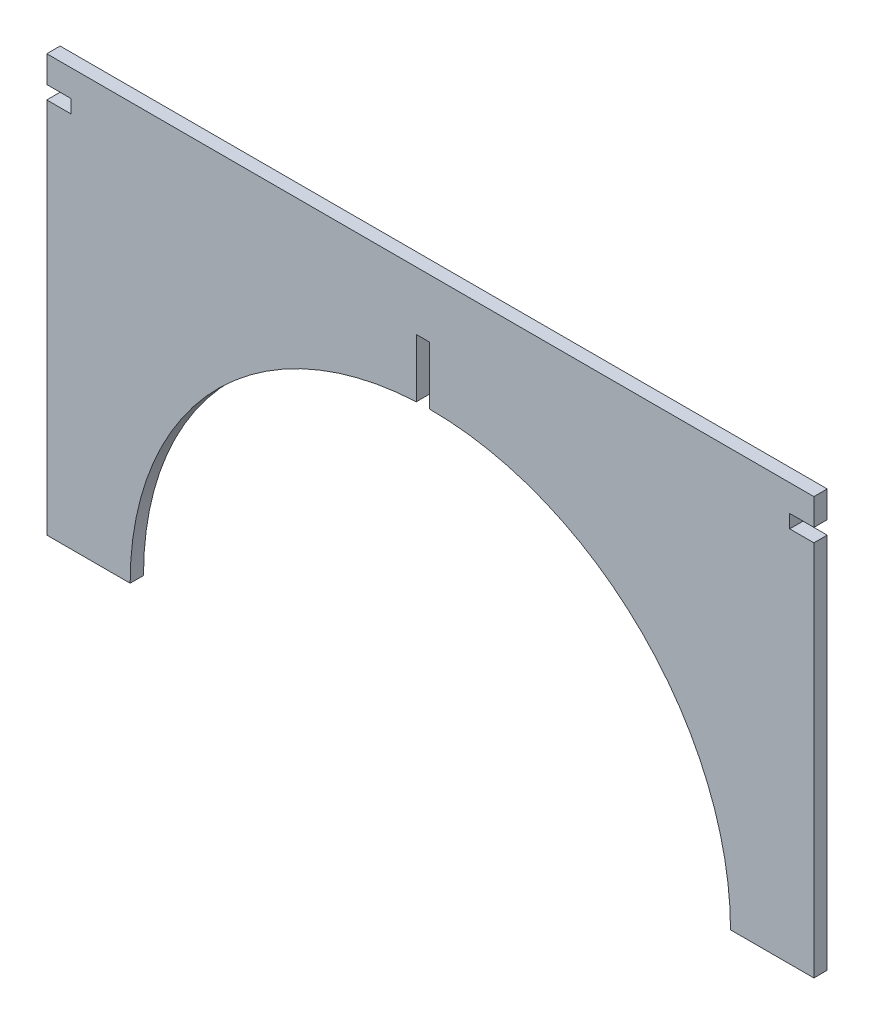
ISO-10303-21;
HEADER;
FILE_DESCRIPTION(('STEP AP214'),'2;1');
FILE_NAME('part.step','',(''),(''),'','','');
FILE_SCHEMA(('AUTOMOTIVE_DESIGN { 1 0 10303 214 1 1 1 1 }'));
ENDSEC;
DATA;
#1=APPLICATION_CONTEXT('core data for automotive mechanical design processes');
#2=APPLICATION_PROTOCOL_DEFINITION('international standard','automotive_design',2000,#1);
#3=PRODUCT_CONTEXT('',#1,'mechanical');
#4=PRODUCT('Part','Part','',(#3));
#5=PRODUCT_RELATED_PRODUCT_CATEGORY('part','',(#4));
#6=PRODUCT_DEFINITION_FORMATION('','',#4);
#7=PRODUCT_DEFINITION_CONTEXT('part definition',#1,'design');
#8=PRODUCT_DEFINITION('design','',#6,#7);
#9=PRODUCT_DEFINITION_SHAPE('','',#8);
#10=(LENGTH_UNIT() NAMED_UNIT(*) SI_UNIT(.MILLI.,.METRE.));
#11=(NAMED_UNIT(*) PLANE_ANGLE_UNIT() SI_UNIT($,.RADIAN.));
#12=(NAMED_UNIT(*) SI_UNIT($,.STERADIAN.) SOLID_ANGLE_UNIT());
#13=UNCERTAINTY_MEASURE_WITH_UNIT(LENGTH_MEASURE(1.E-05),#10,'distance_accuracy_value','');
#14=(GEOMETRIC_REPRESENTATION_CONTEXT(3) GLOBAL_UNCERTAINTY_ASSIGNED_CONTEXT((#13)) GLOBAL_UNIT_ASSIGNED_CONTEXT((#10,
#11,#12)) REPRESENTATION_CONTEXT('',''));
#15=CARTESIAN_POINT('',(0.,0.,0.));
#16=DIRECTION('',(0.,0.,1.));
#17=DIRECTION('',(1.,0.,0.));
#18=AXIS2_PLACEMENT_3D('',#15,#16,#17);
#19=CARTESIAN_POINT('',(-672.642560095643,353.821839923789,16.));
#20=DIRECTION('',(1.,0.,0.));
#21=DIRECTION('',(0.,0.,-1.));
#22=AXIS2_PLACEMENT_3D('',#19,#20,#21);
#23=PLANE('',#22);
#24=DIRECTION('',(0.,-1.,0.));
#25=VECTOR('',#24,1.);
#26=CARTESIAN_POINT('',(-672.642560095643,353.821839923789,16.));
#27=LINE('',#26,#25);
#28=CARTESIAN_POINT('',(-672.642560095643,305.821839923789,16.));
#29=VERTEX_POINT('',#28);
#30=CARTESIAN_POINT('',(-672.642560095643,-146.178160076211,16.));
#31=VERTEX_POINT('',#30);
#32=EDGE_CURVE('E226',#29,#31,#27,.T.);
#33=ORIENTED_EDGE('',*,*,#32,.F.);
#34=DIRECTION('',(0.,0.,1.));
#35=VECTOR('',#34,1.);
#36=CARTESIAN_POINT('',(-672.642560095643,305.821839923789,0.));
#37=LINE('',#36,#35);
#38=CARTESIAN_POINT('',(-672.642560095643,305.821839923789,0.));
#39=VERTEX_POINT('',#38);
#40=EDGE_CURVE('E189',#39,#29,#37,.T.);
#41=ORIENTED_EDGE('',*,*,#40,.F.);
#42=DIRECTION('',(0.,-1.,0.));
#43=VECTOR('',#42,1.);
#44=CARTESIAN_POINT('',(-672.642560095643,353.821839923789,0.));
#45=LINE('',#44,#43);
#46=CARTESIAN_POINT('',(-672.642560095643,-146.178160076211,0.));
#47=VERTEX_POINT('',#46);
#48=EDGE_CURVE('E251',#39,#47,#45,.T.);
#49=ORIENTED_EDGE('',*,*,#48,.T.);
#50=DIRECTION('',(0.,0.,-1.));
#51=VECTOR('',#50,1.);
#52=CARTESIAN_POINT('',(-672.642560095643,-146.178160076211,16.));
#53=LINE('',#52,#51);
#54=EDGE_CURVE('E282',#31,#47,#53,.T.);
#55=ORIENTED_EDGE('',*,*,#54,.F.);
#56=EDGE_LOOP('',(#33,#41,#49,#55));
#57=FACE_BOUND('',#56,.T.);
#58=ADVANCED_FACE('F33',(#57),#23,.F.);
#59=CARTESIAN_POINT('',(247.357439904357,353.821839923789,16.));
#60=DIRECTION('',(-1.,0.,0.));
#61=DIRECTION('',(0.,-1.,0.));
#62=AXIS2_PLACEMENT_3D('',#59,#60,#61);
#63=PLANE('',#62);
#64=DIRECTION('',(0.,1.,0.));
#65=VECTOR('',#64,1.);
#66=CARTESIAN_POINT('',(247.357439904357,353.821839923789,0.));
#67=LINE('',#66,#65);
#68=CARTESIAN_POINT('',(247.357439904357,-146.178160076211,0.));
#69=VERTEX_POINT('',#68);
#70=CARTESIAN_POINT('',(247.357439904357,305.821839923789,0.));
#71=VERTEX_POINT('',#70);
#72=EDGE_CURVE('E246',#69,#71,#67,.T.);
#73=ORIENTED_EDGE('',*,*,#72,.T.);
#74=DIRECTION('',(0.,0.,1.));
#75=VECTOR('',#74,1.);
#76=CARTESIAN_POINT('',(247.357439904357,305.821839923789,0.));
#77=LINE('',#76,#75);
#78=CARTESIAN_POINT('',(247.357439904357,305.821839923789,16.));
#79=VERTEX_POINT('',#78);
#80=EDGE_CURVE('E207',#71,#79,#77,.T.);
#81=ORIENTED_EDGE('',*,*,#80,.T.);
#82=DIRECTION('',(0.,1.,0.));
#83=VECTOR('',#82,1.);
#84=CARTESIAN_POINT('',(247.357439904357,353.821839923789,16.));
#85=LINE('',#84,#83);
#86=CARTESIAN_POINT('',(247.357439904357,-146.178160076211,16.));
#87=VERTEX_POINT('',#86);
#88=EDGE_CURVE('E221',#87,#79,#85,.T.);
#89=ORIENTED_EDGE('',*,*,#88,.F.);
#90=DIRECTION('',(0.,0.,-1.));
#91=VECTOR('',#90,1.);
#92=CARTESIAN_POINT('',(247.357439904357,-146.178160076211,16.));
#93=LINE('',#92,#91);
#94=EDGE_CURVE('E11',#87,#69,#93,.T.);
#95=ORIENTED_EDGE('',*,*,#94,.T.);
#96=EDGE_LOOP('',(#73,#81,#89,#95));
#97=FACE_BOUND('',#96,.T.);
#98=ADVANCED_FACE('F313',(#97),#63,.F.);
#99=CARTESIAN_POINT('',(147.357439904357,-146.178160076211,16.));
#100=DIRECTION('',(0.,1.,0.));
#101=DIRECTION('',(0.,0.,1.));
#102=AXIS2_PLACEMENT_3D('',#99,#100,#101);
#103=PLANE('',#102);
#104=DIRECTION('',(1.,0.,0.));
#105=VECTOR('',#104,1.);
#106=CARTESIAN_POINT('',(147.357439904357,-146.178160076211,0.));
#107=LINE('',#106,#105);
#108=CARTESIAN_POINT('',(147.357439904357,-146.178160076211,0.));
#109=VERTEX_POINT('',#108);
#110=EDGE_CURVE('E210',#109,#69,#107,.T.);
#111=ORIENTED_EDGE('',*,*,#110,.T.);
#112=ORIENTED_EDGE('',*,*,#94,.F.);
#113=DIRECTION('',(1.,0.,0.));
#114=VECTOR('',#113,1.);
#115=CARTESIAN_POINT('',(147.357439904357,-146.178160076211,16.));
#116=LINE('',#115,#114);
#117=CARTESIAN_POINT('',(147.357439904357,-146.178160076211,16.));
#118=VERTEX_POINT('',#117);
#119=EDGE_CURVE('E216',#118,#87,#116,.T.);
#120=ORIENTED_EDGE('',*,*,#119,.F.);
#121=DIRECTION('',(0.,0.,-1.));
#122=VECTOR('',#121,1.);
#123=CARTESIAN_POINT('',(147.357439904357,-146.178160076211,16.));
#124=LINE('',#123,#122);
#125=EDGE_CURVE('E242',#118,#109,#124,.T.);
#126=ORIENTED_EDGE('',*,*,#125,.T.);
#127=EDGE_LOOP('',(#111,#112,#120,#126));
#128=FACE_BOUND('',#127,.T.);
#129=ADVANCED_FACE('F35',(#128),#103,.F.);
#130=CARTESIAN_POINT('',(247.357439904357,321.821839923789,16.));
#131=VERTEX_POINT('',#130);
#132=CARTESIAN_POINT('',(247.357439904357,353.821839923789,16.));
#133=VERTEX_POINT('',#132);
#134=EDGE_CURVE('E219',#131,#133,#85,.T.);
#135=ORIENTED_EDGE('',*,*,#134,.F.);
#136=DIRECTION('',(0.,0.,1.));
#137=VECTOR('',#136,1.);
#138=CARTESIAN_POINT('',(247.357439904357,321.821839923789,0.));
#139=LINE('',#138,#137);
#140=CARTESIAN_POINT('',(247.357439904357,321.821839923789,0.));
#141=VERTEX_POINT('',#140);
#142=EDGE_CURVE('E200',#141,#131,#139,.T.);
#143=ORIENTED_EDGE('',*,*,#142,.F.);
#144=CARTESIAN_POINT('',(247.357439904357,353.821839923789,0.));
#145=VERTEX_POINT('',#144);
#146=EDGE_CURVE('E245',#141,#145,#67,.T.);
#147=ORIENTED_EDGE('',*,*,#146,.T.);
#148=DIRECTION('',(0.,0.,-1.));
#149=VECTOR('',#148,1.);
#150=CARTESIAN_POINT('',(247.357439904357,353.821839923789,16.));
#151=LINE('',#150,#149);
#152=EDGE_CURVE('E41',#133,#145,#151,.T.);
#153=ORIENTED_EDGE('',*,*,#152,.F.);
#154=EDGE_LOOP('',(#135,#143,#147,#153));
#155=FACE_BOUND('',#154,.T.);
#156=ADVANCED_FACE('F306',(#155),#63,.F.);
#157=CARTESIAN_POINT('',(-672.642560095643,353.821839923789,16.));
#158=DIRECTION('',(0.,-1.,0.));
#159=DIRECTION('',(0.,0.,-1.));
#160=AXIS2_PLACEMENT_3D('',#157,#158,#159);
#161=PLANE('',#160);
#162=DIRECTION('',(-1.,0.,0.));
#163=VECTOR('',#162,1.);
#164=CARTESIAN_POINT('',(-672.642560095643,353.821839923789,0.));
#165=LINE('',#164,#163);
#166=CARTESIAN_POINT('',(-672.642560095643,353.821839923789,0.));
#167=VERTEX_POINT('',#166);
#168=EDGE_CURVE('E249',#145,#167,#165,.T.);
#169=ORIENTED_EDGE('',*,*,#168,.T.);
#170=DIRECTION('',(0.,0.,-1.));
#171=VECTOR('',#170,1.);
#172=CARTESIAN_POINT('',(-672.642560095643,353.821839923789,16.));
#173=LINE('',#172,#171);
#174=CARTESIAN_POINT('',(-672.642560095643,353.821839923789,16.));
#175=VERTEX_POINT('',#174);
#176=EDGE_CURVE('E285',#175,#167,#173,.T.);
#177=ORIENTED_EDGE('',*,*,#176,.F.);
#178=DIRECTION('',(-1.,0.,0.));
#179=VECTOR('',#178,1.);
#180=CARTESIAN_POINT('',(-672.642560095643,353.821839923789,16.));
#181=LINE('',#180,#179);
#182=EDGE_CURVE('E224',#133,#175,#181,.T.);
#183=ORIENTED_EDGE('',*,*,#182,.F.);
#184=ORIENTED_EDGE('',*,*,#152,.T.);
#185=EDGE_LOOP('',(#169,#177,#183,#184));
#186=FACE_BOUND('',#185,.T.);
#187=ADVANCED_FACE('F292',(#186),#161,.F.);
#188=CARTESIAN_POINT('',(-672.642560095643,321.821839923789,0.));
#189=VERTEX_POINT('',#188);
#190=EDGE_CURVE('E252',#167,#189,#45,.T.);
#191=ORIENTED_EDGE('',*,*,#190,.T.);
#192=DIRECTION('',(0.,0.,1.));
#193=VECTOR('',#192,1.);
#194=CARTESIAN_POINT('',(-672.642560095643,321.821839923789,0.));
#195=LINE('',#194,#193);
#196=CARTESIAN_POINT('',(-672.642560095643,321.821839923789,16.));
#197=VERTEX_POINT('',#196);
#198=EDGE_CURVE('E48',#189,#197,#195,.T.);
#199=ORIENTED_EDGE('',*,*,#198,.T.);
#200=EDGE_CURVE('E227',#175,#197,#27,.T.);
#201=ORIENTED_EDGE('',*,*,#200,.F.);
#202=ORIENTED_EDGE('',*,*,#176,.T.);
#203=EDGE_LOOP('',(#191,#199,#201,#202));
#204=FACE_BOUND('',#203,.T.);
#205=ADVANCED_FACE('F298',(#204),#23,.F.);
#206=CARTESIAN_POINT('',(-672.642560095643,-146.178160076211,16.));
#207=DIRECTION('',(0.,1.,0.));
#208=DIRECTION('',(0.,0.,1.));
#209=AXIS2_PLACEMENT_3D('',#206,#207,#208);
#210=PLANE('',#209);
#211=DIRECTION('',(1.,0.,0.));
#212=VECTOR('',#211,1.);
#213=CARTESIAN_POINT('',(-672.642560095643,-146.178160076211,0.));
#214=LINE('',#213,#212);
#215=CARTESIAN_POINT('',(-572.642560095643,-146.178160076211,0.));
#216=VERTEX_POINT('',#215);
#217=EDGE_CURVE('E254',#47,#216,#214,.T.);
#218=ORIENTED_EDGE('',*,*,#217,.T.);
#219=DIRECTION('',(0.,0.,-1.));
#220=VECTOR('',#219,1.);
#221=CARTESIAN_POINT('',(-572.642560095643,-146.178160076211,16.));
#222=LINE('',#221,#220);
#223=CARTESIAN_POINT('',(-572.642560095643,-146.178160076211,16.));
#224=VERTEX_POINT('',#223);
#225=EDGE_CURVE('E279',#224,#216,#222,.T.);
#226=ORIENTED_EDGE('',*,*,#225,.F.);
#227=DIRECTION('',(1.,0.,0.));
#228=VECTOR('',#227,1.);
#229=CARTESIAN_POINT('',(-672.642560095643,-146.178160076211,16.));
#230=LINE('',#229,#228);
#231=EDGE_CURVE('E230',#31,#224,#230,.T.);
#232=ORIENTED_EDGE('',*,*,#231,.F.);
#233=ORIENTED_EDGE('',*,*,#54,.T.);
#234=EDGE_LOOP('',(#218,#226,#232,#233));
#235=FACE_BOUND('',#234,.T.);
#236=ADVANCED_FACE('F346',(#235),#210,.F.);
#237=CARTESIAN_POINT('',(-212.642560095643,-145.783589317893,16.));
#238=DIRECTION('',(0.,0.,-1.));
#239=DIRECTION('',(-1.,0.,0.));
#240=AXIS2_PLACEMENT_3D('',#237,#238,#239);
#241=CYLINDRICAL_SURFACE('',#240,360.000216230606);
#242=CARTESIAN_POINT('',(-212.642560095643,-145.783589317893,0.));
#243=DIRECTION('',(0.,0.,-1.));
#244=DIRECTION('',(1.,0.,0.));
#245=AXIS2_PLACEMENT_3D('',#242,#243,#244);
#246=CIRCLE('',#245,360.000216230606);
#247=CARTESIAN_POINT('',(-229.497557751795,213.821839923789,0.));
#248=VERTEX_POINT('',#247);
#249=EDGE_CURVE('E256',#216,#248,#246,.T.);
#250=ORIENTED_EDGE('',*,*,#249,.T.);
#251=DIRECTION('',(0.,0.,-1.));
#252=VECTOR('',#251,1.);
#253=CARTESIAN_POINT('',(-229.497557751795,213.821839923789,16.));
#254=LINE('',#253,#252);
#255=CARTESIAN_POINT('',(-229.497557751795,213.821839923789,16.));
#256=VERTEX_POINT('',#255);
#257=EDGE_CURVE('E276',#256,#248,#254,.T.);
#258=ORIENTED_EDGE('',*,*,#257,.F.);
#259=CARTESIAN_POINT('',(-212.642560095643,-145.783589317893,16.));
#260=DIRECTION('',(0.,0.,-1.));
#261=DIRECTION('',(1.,0.,0.));
#262=AXIS2_PLACEMENT_3D('',#259,#260,#261);
#263=CIRCLE('',#262,360.000216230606);
#264=EDGE_CURVE('E232',#224,#256,#263,.T.);
#265=ORIENTED_EDGE('',*,*,#264,.F.);
#266=ORIENTED_EDGE('',*,*,#225,.T.);
#267=EDGE_LOOP('',(#250,#258,#265,#266));
#268=FACE_BOUND('',#267,.T.);
#269=ADVANCED_FACE('F342',(#268),#241,.F.);
#270=CARTESIAN_POINT('',(-229.497557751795,283.821839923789,16.));
#271=DIRECTION('',(-1.,0.,0.));
#272=DIRECTION('',(0.,0.,1.));
#273=AXIS2_PLACEMENT_3D('',#270,#271,#272);
#274=PLANE('',#273);
#275=DIRECTION('',(0.,1.,0.));
#276=VECTOR('',#275,1.);
#277=CARTESIAN_POINT('',(-229.497557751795,283.821839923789,0.));
#278=LINE('',#277,#276);
#279=CARTESIAN_POINT('',(-229.497557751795,283.821839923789,0.));
#280=VERTEX_POINT('',#279);
#281=EDGE_CURVE('E258',#248,#280,#278,.T.);
#282=ORIENTED_EDGE('',*,*,#281,.T.);
#283=DIRECTION('',(0.,0.,-1.));
#284=VECTOR('',#283,1.);
#285=CARTESIAN_POINT('',(-229.497557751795,283.821839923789,16.));
#286=LINE('',#285,#284);
#287=CARTESIAN_POINT('',(-229.497557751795,283.821839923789,16.));
#288=VERTEX_POINT('',#287);
#289=EDGE_CURVE('E273',#288,#280,#286,.T.);
#290=ORIENTED_EDGE('',*,*,#289,.F.);
#291=DIRECTION('',(0.,1.,0.));
#292=VECTOR('',#291,1.);
#293=CARTESIAN_POINT('',(-229.497557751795,283.821839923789,16.));
#294=LINE('',#293,#292);
#295=EDGE_CURVE('E234',#256,#288,#294,.T.);
#296=ORIENTED_EDGE('',*,*,#295,.F.);
#297=ORIENTED_EDGE('',*,*,#257,.T.);
#298=EDGE_LOOP('',(#282,#290,#296,#297));
#299=FACE_BOUND('',#298,.T.);
#300=ADVANCED_FACE('F337',(#299),#274,.F.);
#301=CARTESIAN_POINT('',(-229.497557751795,283.821839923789,16.));
#302=DIRECTION('',(0.,1.,0.));
#303=DIRECTION('',(0.,0.,1.));
#304=AXIS2_PLACEMENT_3D('',#301,#302,#303);
#305=PLANE('',#304);
#306=DIRECTION('',(1.,0.,0.));
#307=VECTOR('',#306,1.);
#308=CARTESIAN_POINT('',(-229.497557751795,283.821839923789,0.));
#309=LINE('',#308,#307);
#310=CARTESIAN_POINT('',(-213.497557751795,283.821839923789,0.));
#311=VERTEX_POINT('',#310);
#312=EDGE_CURVE('E260',#280,#311,#309,.T.);
#313=ORIENTED_EDGE('',*,*,#312,.T.);
#314=DIRECTION('',(0.,0.,-1.));
#315=VECTOR('',#314,1.);
#316=CARTESIAN_POINT('',(-213.497557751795,283.821839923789,16.));
#317=LINE('',#316,#315);
#318=CARTESIAN_POINT('',(-213.497557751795,283.821839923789,16.));
#319=VERTEX_POINT('',#318);
#320=EDGE_CURVE('E270',#319,#311,#317,.T.);
#321=ORIENTED_EDGE('',*,*,#320,.F.);
#322=DIRECTION('',(1.,0.,0.));
#323=VECTOR('',#322,1.);
#324=CARTESIAN_POINT('',(-229.497557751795,283.821839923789,16.));
#325=LINE('',#324,#323);
#326=EDGE_CURVE('E236',#288,#319,#325,.T.);
#327=ORIENTED_EDGE('',*,*,#326,.F.);
#328=ORIENTED_EDGE('',*,*,#289,.T.);
#329=EDGE_LOOP('',(#313,#321,#327,#328));
#330=FACE_BOUND('',#329,.T.);
#331=ADVANCED_FACE('F331',(#330),#305,.F.);
#332=CARTESIAN_POINT('',(-213.497557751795,283.821839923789,16.));
#333=DIRECTION('',(1.,0.,0.));
#334=DIRECTION('',(0.,0.,-1.));
#335=AXIS2_PLACEMENT_3D('',#332,#333,#334);
#336=PLANE('',#335);
#337=DIRECTION('',(0.,-1.,0.));
#338=VECTOR('',#337,1.);
#339=CARTESIAN_POINT('',(-213.497557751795,283.821839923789,0.));
#340=LINE('',#339,#338);
#341=CARTESIAN_POINT('',(-213.497557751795,214.215611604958,0.));
#342=VERTEX_POINT('',#341);
#343=EDGE_CURVE('E262',#311,#342,#340,.T.);
#344=ORIENTED_EDGE('',*,*,#343,.T.);
#345=DIRECTION('',(0.,0.,-1.));
#346=VECTOR('',#345,1.);
#347=CARTESIAN_POINT('',(-213.497557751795,214.215611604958,16.));
#348=LINE('',#347,#346);
#349=CARTESIAN_POINT('',(-213.497557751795,214.215611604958,16.));
#350=VERTEX_POINT('',#349);
#351=EDGE_CURVE('E267',#350,#342,#348,.T.);
#352=ORIENTED_EDGE('',*,*,#351,.F.);
#353=DIRECTION('',(0.,-1.,0.));
#354=VECTOR('',#353,1.);
#355=CARTESIAN_POINT('',(-213.497557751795,283.821839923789,16.));
#356=LINE('',#355,#354);
#357=EDGE_CURVE('E238',#319,#350,#356,.T.);
#358=ORIENTED_EDGE('',*,*,#357,.F.);
#359=ORIENTED_EDGE('',*,*,#320,.T.);
#360=EDGE_LOOP('',(#344,#352,#358,#359));
#361=FACE_BOUND('',#360,.T.);
#362=ADVANCED_FACE('F327',(#361),#336,.F.);
#363=CARTESIAN_POINT('',(-212.642560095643,-145.783589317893,16.));
#364=DIRECTION('',(0.,0.,-1.));
#365=DIRECTION('',(-1.,0.,0.));
#366=AXIS2_PLACEMENT_3D('',#363,#364,#365);
#367=CYLINDRICAL_SURFACE('',#366,360.000216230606);
#368=CARTESIAN_POINT('',(-212.642560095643,-145.783589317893,0.));
#369=DIRECTION('',(0.,0.,-1.));
#370=DIRECTION('',(1.,0.,0.));
#371=AXIS2_PLACEMENT_3D('',#368,#369,#370);
#372=CIRCLE('',#371,360.000216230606);
#373=EDGE_CURVE('E220',#342,#109,#372,.T.);
#374=ORIENTED_EDGE('',*,*,#373,.T.);
#375=ORIENTED_EDGE('',*,*,#125,.F.);
#376=CARTESIAN_POINT('',(-212.642560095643,-145.783589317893,16.));
#377=DIRECTION('',(0.,0.,-1.));
#378=DIRECTION('',(1.,0.,0.));
#379=AXIS2_PLACEMENT_3D('',#376,#377,#378);
#380=CIRCLE('',#379,360.000216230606);
#381=EDGE_CURVE('E240',#350,#118,#380,.T.);
#382=ORIENTED_EDGE('',*,*,#381,.F.);
#383=ORIENTED_EDGE('',*,*,#351,.T.);
#384=EDGE_LOOP('',(#374,#375,#382,#383));
#385=FACE_BOUND('',#384,.T.);
#386=ADVANCED_FACE('F322',(#385),#367,.F.);
#387=CARTESIAN_POINT('',(-212.642560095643,-145.783589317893,16.));
#388=DIRECTION('',(0.,0.,1.));
#389=DIRECTION('',(1.,0.,0.));
#390=AXIS2_PLACEMENT_3D('',#387,#388,#389);
#391=PLANE('',#390);
#392=DIRECTION('',(1.,0.,0.));
#393=VECTOR('',#392,1.);
#394=CARTESIAN_POINT('',(-672.642560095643,305.821839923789,16.));
#395=LINE('',#394,#393);
#396=CARTESIAN_POINT('',(-643.642560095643,305.821839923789,16.));
#397=VERTEX_POINT('',#396);
#398=EDGE_CURVE('E177',#29,#397,#395,.T.);
#399=ORIENTED_EDGE('',*,*,#398,.F.);
#400=ORIENTED_EDGE('',*,*,#32,.T.);
#401=ORIENTED_EDGE('',*,*,#231,.T.);
#402=ORIENTED_EDGE('',*,*,#264,.T.);
#403=ORIENTED_EDGE('',*,*,#295,.T.);
#404=ORIENTED_EDGE('',*,*,#326,.T.);
#405=ORIENTED_EDGE('',*,*,#357,.T.);
#406=ORIENTED_EDGE('',*,*,#381,.T.);
#407=ORIENTED_EDGE('',*,*,#119,.T.);
#408=ORIENTED_EDGE('',*,*,#88,.T.);
#409=DIRECTION('',(1.,0.,0.));
#410=VECTOR('',#409,1.);
#411=CARTESIAN_POINT('',(218.357439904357,305.821839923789,16.));
#412=LINE('',#411,#410);
#413=CARTESIAN_POINT('',(218.357439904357,305.821839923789,16.));
#414=VERTEX_POINT('',#413);
#415=EDGE_CURVE('E195',#414,#79,#412,.T.);
#416=ORIENTED_EDGE('',*,*,#415,.F.);
#417=DIRECTION('',(0.,-1.,0.));
#418=VECTOR('',#417,1.);
#419=CARTESIAN_POINT('',(218.357439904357,321.821839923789,16.));
#420=LINE('',#419,#418);
#421=CARTESIAN_POINT('',(218.357439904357,321.821839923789,16.));
#422=VERTEX_POINT('',#421);
#423=EDGE_CURVE('E203',#422,#414,#420,.T.);
#424=ORIENTED_EDGE('',*,*,#423,.F.);
#425=DIRECTION('',(-1.,0.,0.));
#426=VECTOR('',#425,1.);
#427=CARTESIAN_POINT('',(218.357439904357,321.821839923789,16.));
#428=LINE('',#427,#426);
#429=EDGE_CURVE('E188',#131,#422,#428,.T.);
#430=ORIENTED_EDGE('',*,*,#429,.F.);
#431=ORIENTED_EDGE('',*,*,#134,.T.);
#432=ORIENTED_EDGE('',*,*,#182,.T.);
#433=ORIENTED_EDGE('',*,*,#200,.T.);
#434=DIRECTION('',(-1.,0.,0.));
#435=VECTOR('',#434,1.);
#436=CARTESIAN_POINT('',(-672.642560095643,321.821839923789,16.));
#437=LINE('',#436,#435);
#438=CARTESIAN_POINT('',(-643.642560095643,321.821839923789,16.));
#439=VERTEX_POINT('',#438);
#440=EDGE_CURVE('E180',#439,#197,#437,.T.);
#441=ORIENTED_EDGE('',*,*,#440,.F.);
#442=DIRECTION('',(0.,1.,0.));
#443=VECTOR('',#442,1.);
#444=CARTESIAN_POINT('',(-643.642560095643,321.821839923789,16.));
#445=LINE('',#444,#443);
#446=EDGE_CURVE('E165',#397,#439,#445,.T.);
#447=ORIENTED_EDGE('',*,*,#446,.F.);
#448=EDGE_LOOP('',(#399,#400,#401,#402,#403,#404,#405,#406,#407,#408,#416,#424,#430,#431,#432,
#433,#441,#447));
#449=FACE_BOUND('',#448,.T.);
#450=ADVANCED_FACE('F302',(#449),#391,.T.);
#451=CARTESIAN_POINT('',(-212.642560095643,-145.783589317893,0.));
#452=DIRECTION('',(0.,0.,1.));
#453=DIRECTION('',(1.,0.,0.));
#454=AXIS2_PLACEMENT_3D('',#451,#452,#453);
#455=PLANE('',#454);
#456=ORIENTED_EDGE('',*,*,#48,.F.);
#457=DIRECTION('',(1.,0.,0.));
#458=VECTOR('',#457,1.);
#459=CARTESIAN_POINT('',(-672.642560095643,305.821839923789,0.));
#460=LINE('',#459,#458);
#461=CARTESIAN_POINT('',(-643.642560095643,305.821839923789,0.));
#462=VERTEX_POINT('',#461);
#463=EDGE_CURVE('E167',#39,#462,#460,.T.);
#464=ORIENTED_EDGE('',*,*,#463,.T.);
#465=DIRECTION('',(0.,1.,0.));
#466=VECTOR('',#465,1.);
#467=CARTESIAN_POINT('',(-643.642560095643,321.821839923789,0.));
#468=LINE('',#467,#466);
#469=CARTESIAN_POINT('',(-643.642560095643,321.821839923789,0.));
#470=VERTEX_POINT('',#469);
#471=EDGE_CURVE('E162',#462,#470,#468,.T.);
#472=ORIENTED_EDGE('',*,*,#471,.T.);
#473=DIRECTION('',(-1.,0.,0.));
#474=VECTOR('',#473,1.);
#475=CARTESIAN_POINT('',(-672.642560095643,321.821839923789,0.));
#476=LINE('',#475,#474);
#477=EDGE_CURVE('E169',#470,#189,#476,.T.);
#478=ORIENTED_EDGE('',*,*,#477,.T.);
#479=ORIENTED_EDGE('',*,*,#190,.F.);
#480=ORIENTED_EDGE('',*,*,#168,.F.);
#481=ORIENTED_EDGE('',*,*,#146,.F.);
#482=DIRECTION('',(-1.,0.,0.));
#483=VECTOR('',#482,1.);
#484=CARTESIAN_POINT('',(218.357439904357,321.821839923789,0.));
#485=LINE('',#484,#483);
#486=CARTESIAN_POINT('',(218.357439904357,321.821839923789,0.));
#487=VERTEX_POINT('',#486);
#488=EDGE_CURVE('E192',#141,#487,#485,.T.);
#489=ORIENTED_EDGE('',*,*,#488,.T.);
#490=DIRECTION('',(0.,-1.,0.));
#491=VECTOR('',#490,1.);
#492=CARTESIAN_POINT('',(218.357439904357,321.821839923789,0.));
#493=LINE('',#492,#491);
#494=CARTESIAN_POINT('',(218.357439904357,305.821839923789,0.));
#495=VERTEX_POINT('',#494);
#496=EDGE_CURVE('E56',#487,#495,#493,.T.);
#497=ORIENTED_EDGE('',*,*,#496,.T.);
#498=DIRECTION('',(1.,0.,0.));
#499=VECTOR('',#498,1.);
#500=CARTESIAN_POINT('',(218.357439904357,305.821839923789,0.));
#501=LINE('',#500,#499);
#502=EDGE_CURVE('E197',#495,#71,#501,.T.);
#503=ORIENTED_EDGE('',*,*,#502,.T.);
#504=ORIENTED_EDGE('',*,*,#72,.F.);
#505=ORIENTED_EDGE('',*,*,#110,.F.);
#506=ORIENTED_EDGE('',*,*,#373,.F.);
#507=ORIENTED_EDGE('',*,*,#343,.F.);
#508=ORIENTED_EDGE('',*,*,#312,.F.);
#509=ORIENTED_EDGE('',*,*,#281,.F.);
#510=ORIENTED_EDGE('',*,*,#249,.F.);
#511=ORIENTED_EDGE('',*,*,#217,.F.);
#512=EDGE_LOOP('',(#456,#464,#472,#478,#479,#480,#481,#489,#497,#503,#504,#505,#506,#507,#508,
#509,#510,#511));
#513=FACE_BOUND('',#512,.T.);
#514=ADVANCED_FACE('F176',(#513),#455,.F.);
#515=CARTESIAN_POINT('',(218.357439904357,305.821839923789,0.));
#516=DIRECTION('',(0.,-1.,0.));
#517=DIRECTION('',(0.,0.,-1.));
#518=AXIS2_PLACEMENT_3D('',#515,#516,#517);
#519=PLANE('',#518);
#520=ORIENTED_EDGE('',*,*,#415,.T.);
#521=ORIENTED_EDGE('',*,*,#80,.F.);
#522=ORIENTED_EDGE('',*,*,#502,.F.);
#523=DIRECTION('',(0.,0.,1.));
#524=VECTOR('',#523,1.);
#525=CARTESIAN_POINT('',(218.357439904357,305.821839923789,0.));
#526=LINE('',#525,#524);
#527=EDGE_CURVE('E211',#495,#414,#526,.T.);
#528=ORIENTED_EDGE('',*,*,#527,.T.);
#529=EDGE_LOOP('',(#520,#521,#522,#528));
#530=FACE_BOUND('',#529,.T.);
#531=ADVANCED_FACE('F354',(#530),#519,.F.);
#532=CARTESIAN_POINT('',(218.357439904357,321.821839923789,0.));
#533=DIRECTION('',(-1.,0.,0.));
#534=DIRECTION('',(0.,0.,1.));
#535=AXIS2_PLACEMENT_3D('',#532,#533,#534);
#536=PLANE('',#535);
#537=ORIENTED_EDGE('',*,*,#423,.T.);
#538=ORIENTED_EDGE('',*,*,#527,.F.);
#539=ORIENTED_EDGE('',*,*,#496,.F.);
#540=DIRECTION('',(0.,0.,1.));
#541=VECTOR('',#540,1.);
#542=CARTESIAN_POINT('',(218.357439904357,321.821839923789,0.));
#543=LINE('',#542,#541);
#544=EDGE_CURVE('E213',#487,#422,#543,.T.);
#545=ORIENTED_EDGE('',*,*,#544,.T.);
#546=EDGE_LOOP('',(#537,#538,#539,#545));
#547=FACE_BOUND('',#546,.T.);
#548=ADVANCED_FACE('F355',(#547),#536,.F.);
#549=CARTESIAN_POINT('',(218.357439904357,321.821839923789,0.));
#550=DIRECTION('',(0.,1.,0.));
#551=DIRECTION('',(0.,0.,1.));
#552=AXIS2_PLACEMENT_3D('',#549,#550,#551);
#553=PLANE('',#552);
#554=ORIENTED_EDGE('',*,*,#429,.T.);
#555=ORIENTED_EDGE('',*,*,#544,.F.);
#556=ORIENTED_EDGE('',*,*,#488,.F.);
#557=ORIENTED_EDGE('',*,*,#142,.T.);
#558=EDGE_LOOP('',(#554,#555,#556,#557));
#559=FACE_BOUND('',#558,.T.);
#560=ADVANCED_FACE('F308',(#559),#553,.F.);
#561=CARTESIAN_POINT('',(-643.642560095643,321.821839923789,0.));
#562=DIRECTION('',(1.,0.,0.));
#563=DIRECTION('',(0.,1.,0.));
#564=AXIS2_PLACEMENT_3D('',#561,#562,#563);
#565=PLANE('',#564);
#566=ORIENTED_EDGE('',*,*,#446,.T.);
#567=DIRECTION('',(0.,0.,1.));
#568=VECTOR('',#567,1.);
#569=CARTESIAN_POINT('',(-643.642560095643,321.821839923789,0.));
#570=LINE('',#569,#568);
#571=EDGE_CURVE('E159',#470,#439,#570,.T.);
#572=ORIENTED_EDGE('',*,*,#571,.F.);
#573=ORIENTED_EDGE('',*,*,#471,.F.);
#574=DIRECTION('',(0.,0.,1.));
#575=VECTOR('',#574,1.);
#576=CARTESIAN_POINT('',(-643.642560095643,305.821839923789,0.));
#577=LINE('',#576,#575);
#578=EDGE_CURVE('E186',#462,#397,#577,.T.);
#579=ORIENTED_EDGE('',*,*,#578,.T.);
#580=EDGE_LOOP('',(#566,#572,#573,#579));
#581=FACE_BOUND('',#580,.T.);
#582=ADVANCED_FACE('F160',(#581),#565,.F.);
#583=CARTESIAN_POINT('',(-672.642560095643,305.821839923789,0.));
#584=DIRECTION('',(0.,-1.,0.));
#585=DIRECTION('',(0.,0.,-1.));
#586=AXIS2_PLACEMENT_3D('',#583,#584,#585);
#587=PLANE('',#586);
#588=ORIENTED_EDGE('',*,*,#398,.T.);
#589=ORIENTED_EDGE('',*,*,#578,.F.);
#590=ORIENTED_EDGE('',*,*,#463,.F.);
#591=ORIENTED_EDGE('',*,*,#40,.T.);
#592=EDGE_LOOP('',(#588,#589,#590,#591));
#593=FACE_BOUND('',#592,.T.);
#594=ADVANCED_FACE('F352',(#593),#587,.F.);
#595=CARTESIAN_POINT('',(-672.642560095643,321.821839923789,0.));
#596=DIRECTION('',(0.,1.,0.));
#597=DIRECTION('',(0.,0.,1.));
#598=AXIS2_PLACEMENT_3D('',#595,#596,#597);
#599=PLANE('',#598);
#600=ORIENTED_EDGE('',*,*,#440,.T.);
#601=ORIENTED_EDGE('',*,*,#198,.F.);
#602=ORIENTED_EDGE('',*,*,#477,.F.);
#603=ORIENTED_EDGE('',*,*,#571,.T.);
#604=EDGE_LOOP('',(#600,#601,#602,#603));
#605=FACE_BOUND('',#604,.T.);
#606=ADVANCED_FACE('F170',(#605),#599,.F.);
#607=CLOSED_SHELL('',(#58,#98,#129,#156,#187,#205,#236,#269,#300,#331,#362,#386,#450,#514,#531,
#548,#560,#582,#594,#606));
#608=MANIFOLD_SOLID_BREP('B2',#607);
#609=ADVANCED_BREP_SHAPE_REPRESENTATION('',(#18,#608),#14);
#610=SHAPE_DEFINITION_REPRESENTATION(#9,#609);
ENDSEC;
END-ISO-10303-21;
